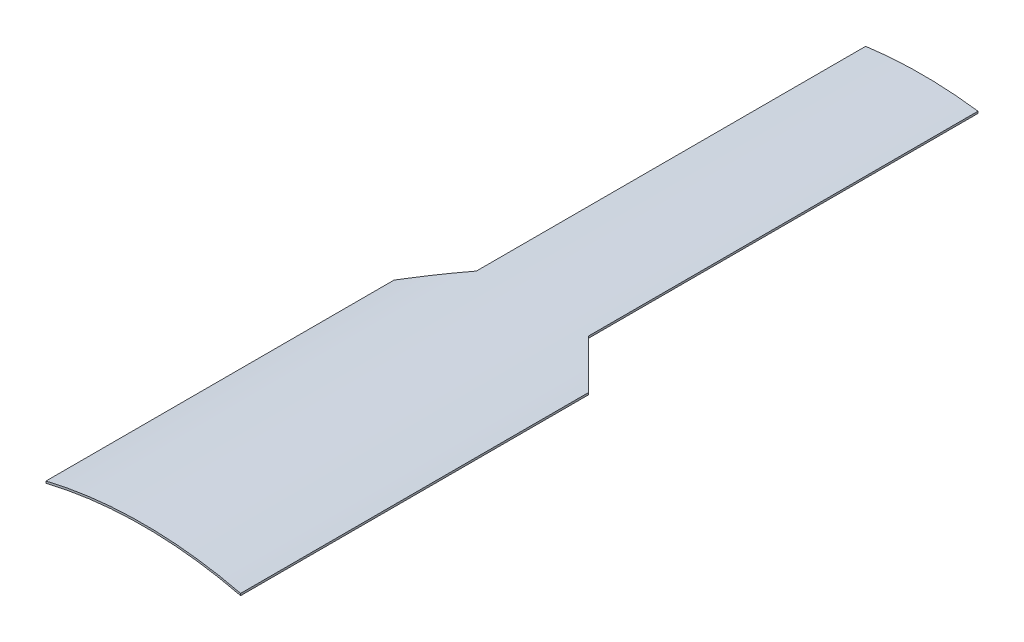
from build123d import *

# Parameters (mm, degrees)
EXTRUDE1_DEPTH     = 50.8
CUT_EXTRUDE1_DEPTH = 50.8


with BuildPart() as part:
    # Sketch1 → Extrude1 (new body)
    with BuildSketch(Plane.XY):
        with BuildLine():
            Line((-6.35, 26.229804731), (-6.35, 26.099117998))
            ThreePointArc((-6.35, 26.099117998), (0, 26.8605), (6.35, 26.099117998))
            Line((6.35, 26.099117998), (6.35, 26.229804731))
            ThreePointArc((6.35, 26.229804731), (0, 26.9875), (-6.35, 26.229804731))
        make_face()
    extrude(amount=EXTRUDE1_DEPTH)

    # Sketch2 → Cut-Extrude1 (cut)
    with BuildSketch(Plane(origin=(0, 0, 0), x_dir=(1, 0, 0), z_dir=(0, 1, 0))):
        Polygon((-3.665419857, 0), (3.665419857, 0), (3.665419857, -25.4), (6.35, -28.084580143), (6.35, 2.056083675), (-6.35, 2.056083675), (-6.35, -28.084580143), (-3.665419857, -25.4), align=None)
    extrude(amount=CUT_EXTRUDE1_DEPTH, mode=Mode.SUBTRACT)


solid = part.part
